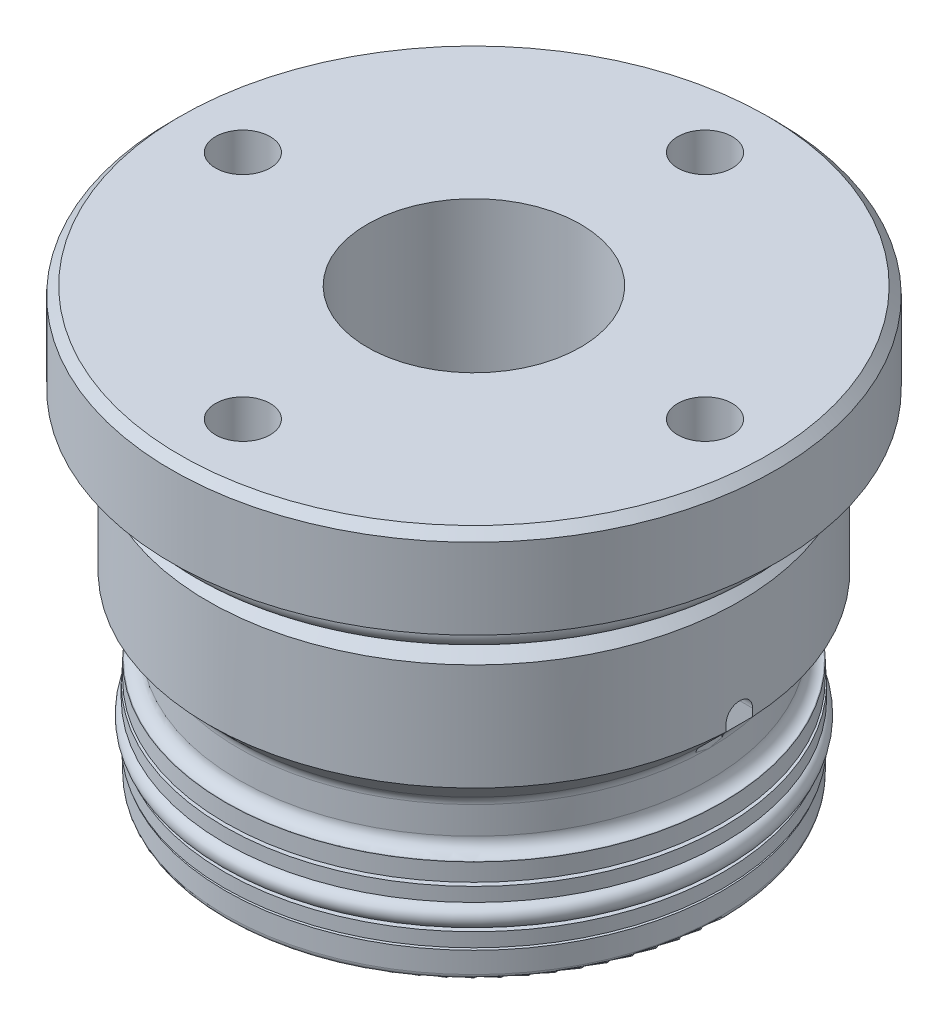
from build123d import *

# Parameters (mm, degrees)
FILLET1_R               = 1.143
FILLET2_R               = 0.381
FILLET3_R               = 0.508
CIRPATTERN1_COUNT       = 4
CHAMFER1_SIZE           = 0.762000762
FILLET4_R               = 0.381
SKETCH5_R               = 1.3081
SKETCH6_R               = 0.889
SKETCH6_W               = 1.3462
SKETCH6_H               = 1.2446
CUT_EXTRUDE1_DEPTH      = 54.928288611
CUT_EXTRUDE1_DEPTH_BACK = 54.928288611
SKETCH7_R               = 1.1811
CUT_EXTRUDE3_START      = 20.9931
CUT_EXTRUDE3_DEPTH      = 27.686


with BuildPart() as part:
    # Sketch1 → Revolve1 (revolve)
    with BuildSketch(Plane.XY, mode=Mode.PRIVATE) as revolve1_sk:
        Polygon((-17.4625, 0), (-17.4625, 18.2372), (-9.525, 18.2372), (-9.525, 38.1), (-26.9875, 38.1), (-26.9875, 30.1498), (-23.7363, 30.1498), (-23.7363, 16.0274), (-20.9931, 13.2842), (-20.9931, 9.2202), (-22.1869, 9.2202), (-22.1869, 7.6454), (-20.9296, 7.6454), (-20.9296, 2.3876), (-22.1869, 2.3876), (-22.1869, 0), align=None)
    revolve(revolve1_sk.sketch.rotate(Axis((0, 0, 0), (0, 1, 0)), 270), axis=Axis((0, 0, 0), (0, 1, 0)))

    # Fillet1
    fillet1_edges = [part.edges().sort_by_distance(p)[0] for p in [
        (0, 9.2202, 20.9931),
        (0, 13.2842, 20.9931),
    ]]
    fillet(fillet1_edges, radius=FILLET1_R)

    # Fillet2
    fillet2_edges = [part.edges().sort_by_distance(p)[0] for p in [
        (0, 2.3876, 20.9296),
        (0, 7.6454, 20.9296),
    ]]
    fillet(fillet2_edges, radius=FILLET2_R)

    # Fillet3
    fillet3_edges = [part.edges().sort_by_distance(p)[0] for p in [
        (0, 0, 22.1869),
    ]]
    fillet(fillet3_edges, radius=FILLET3_R)

    # Sketch2 → Hole1 (revolve, cut)
    with BuildSketch(Plane(origin=(20.6375, 38.1, 0), x_dir=(0, 0, 1), z_dir=(1, 0, 0))):
        Polygon((0, 0), (0, 6.214938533), (2.4384, 4.7498), (2.4384, 0), align=None)
    hole1 = revolve(axis=Axis((20.6375, 42.344199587, 0), (0, -1, 0)), mode=Mode.SUBTRACT)

    # CirPattern1: Hole1 ×4 about axis
    cirpattern1_axis = Axis((0, 0, 0), (0, 1, 0))
    for i in range(1, CIRPATTERN1_COUNT):
        add(hole1.rotate(cirpattern1_axis, i * 360 / CIRPATTERN1_COUNT), mode=Mode.SUBTRACT)

    # Chamfer1
    chamfer1_edges = [part.edges().sort_by_distance(p)[0] for p in [
        (0, 38.1, 26.9875),
    ]]
    chamfer(chamfer1_edges, length=CHAMFER1_SIZE)

    # Sketch4 → Cut-Revolve1 (revolve, cut)
    with BuildSketch(Plane.XY, mode=Mode.PRIVATE) as cut_revolve1_sk:
        Polygon((-23.7363, 30.1498), (-23.7363, 25.5524), (-22.5933, 26.6954), (-22.5933, 30.1498), align=None)
    revolve(cut_revolve1_sk.sketch.rotate(Axis((0, 0, 0), (0, 1, 0)), 270), axis=Axis((0, 0, 0), (0, 1, 0)), mode=Mode.SUBTRACT)

    # Fillet4
    fillet4_edges = [part.edges().sort_by_distance(p)[0] for p in [
        (0, 30.1498, 22.5933),
        (0, 26.6954, 22.5933),
    ]]
    fillet(fillet4_edges, radius=FILLET4_R)

    # Sketch5 → Revolve2 (revolve)
    with BuildSketch(Plane.XY, mode=Mode.PRIVATE) as revolve2_sk:
        with Locations((-23.8633, 28.8036)):
            Circle(SKETCH5_R)
    revolve(revolve2_sk.sketch.rotate(Axis((0, 0, 0), (0, 1, 0)), 270), axis=Axis((0, 0, 0), (0, 1, 0)))

    # Sketch6 → Revolve3 (revolve)
    with BuildSketch(Plane.XY, mode=Mode.PRIVATE) as revolve3_sk:
        with Locations((-21.7678, 4.9276)):
            Circle(SKETCH6_R)
        with Locations((-21.6027, 6.7691)):
            Rectangle(SKETCH6_W, SKETCH6_H)
        with Locations((-21.6027, 3.2639)):
            Rectangle(SKETCH6_W, SKETCH6_H)
    revolve(revolve3_sk.sketch.rotate(Axis((0, 0, 0), (0, 1, 0)), 270), axis=Axis((0, 0, 0), (0, 1, 0)))

    # Sketch7 → Cut-Extrude1 (cut, two sides: drawn at the far end of the back side and taken through both)
    with BuildSketch(Plane(origin=(0, 0, 0), x_dir=(0, 0, -1), z_dir=(1, 0, 0)).offset(-CUT_EXTRUDE1_DEPTH_BACK)):
        with Locations((0, 16.6878)):
            Circle(SKETCH7_R)
    extrude(amount=CUT_EXTRUDE1_DEPTH + CUT_EXTRUDE1_DEPTH_BACK, mode=Mode.SUBTRACT)

    # Sketch8 → Cut-Extrude3 (cut)
    with BuildSketch(Plane(origin=(0, 0, 0), x_dir=(0, 0, -1), z_dir=(1, 0, 0)).offset(CUT_EXTRUDE3_START)):
        with BuildLine():
            Line((-1.1811, 16.6878), (-1.1811, 11.9253))
            ThreePointArc((-1.1811, 11.9253), (0, 10.7442), (1.1811, 11.9253))
            Line((1.1811, 11.9253), (1.1811, 16.6878))
            ThreePointArc((1.1811, 16.6878), (0, 17.8689), (-1.1811, 16.6878))
        make_face()
    cut_extrude3 = extrude(amount=CUT_EXTRUDE3_DEPTH, mode=Mode.SUBTRACT)

    # Mirror1: Cut-Extrude3 across plane
    add(cut_extrude3.mirror(Plane(origin=(0, 0, 0), x_dir=(0, 0, 1), z_dir=(1, 0, 0))), mode=Mode.SUBTRACT)


solid = part.part
